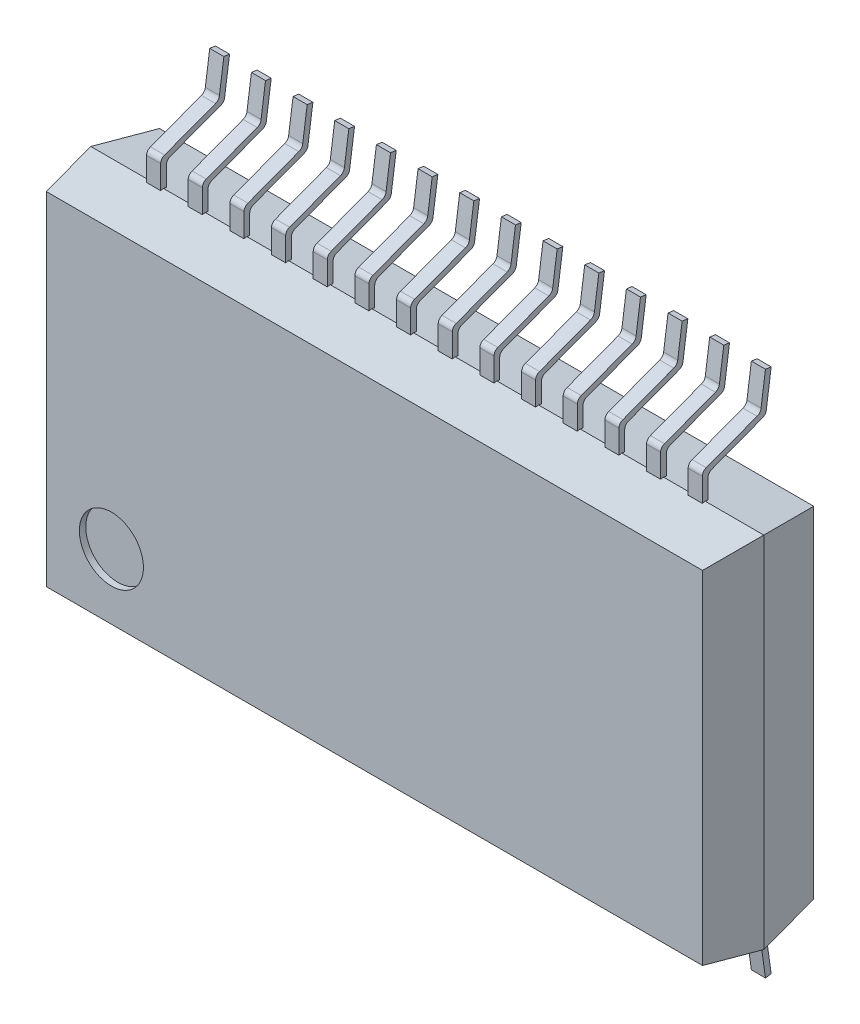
from build123d import *

# Parameters (mm, degrees)
ESBO_O1_W                  = 10.5
ESBO_O1_H                  = 5.6
EXTRUS_O1_DEPTH            = 0.925
EXTRUS_O1_TAPER            = 9
ESBO_O2_W                  = 10.5
ESBO_O2_H                  = 5.6
EXTRUS_O2_DEPTH            = 0.925
EXTRUS_O2_DRAFT            = -9
EXTRUS_O3_DEPTH            = 0.22
EXTRUS_O3_2_DEPTH          = 0.22
PADR_O_LINEAR2_COUNT       = 14
PADR_O_LINEAR2_PITCH       = 0.65
CORTE_EXTRUS_O1_DEPTH      = 0.2
CORTE_EXTRUS_O1_DEPTH_BACK = 0.2
CORTE_EXTRUS_O1_START      = 0.925
ESBO_O7_R                  = 0.5
SKETCH2_W                  = 11.354221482
SKETCH2_H                  = 6.392794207
CUT_EXTRUDE1_DEPTH         = 0.1


with BuildPart() as part:
    # Esbo_o1 → Extrus_o1 (new body)
    with BuildSketch(Plane.XY):
        with Locations((4.335, 2.8)):
            Rectangle(ESBO_O1_W, ESBO_O1_H)
    extrude(amount=EXTRUS_O1_DEPTH, taper=EXTRUS_O1_TAPER)

    # Esbo_o7 → Corte-extrus_o1 (cut, two sides: drawn at the far end of the back side and taken through both)
    with BuildSketch(Plane.XY.offset(CORTE_EXTRUS_O1_START - CORTE_EXTRUS_O1_DEPTH_BACK)):
        with Locations((0.231505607, 1.146505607)):
            Circle(ESBO_O7_R)
    extrude(amount=CORTE_EXTRUS_O1_DEPTH + CORTE_EXTRUS_O1_DEPTH_BACK, mode=Mode.SUBTRACT)

    # Sketch2 → Cut-Extrude1 (cut)
    with BuildSketch(Plane.XY.offset(0.925)):
        with Locations((4.194764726, 2.887042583)):
            Rectangle(SKETCH2_W, SKETCH2_H)
    extrude(amount=-CUT_EXTRUDE1_DEPTH, mode=Mode.SUBTRACT)


with BuildPart() as body_2:
    # Esbo_o2 → Extrus_o2 (with draft: the straight prism first)
    with BuildSketch(Plane.XY):
        with Locations((4.335, 2.8)):
            Rectangle(ESBO_O2_W, ESBO_O2_H)
    extrude(amount=-EXTRUS_O2_DEPTH)
    # Extrus_o2: the draft: its side faces are tilted about the plane it starts from
    extrus_o2_sides = [body_2.faces().sort_by_distance(p)[0] for p in [
        (-0.915, 2.8, -0.4625),
        (4.335, 0, -0.4625),
        (9.585, 2.8, -0.4625),
        (4.335, 5.6, -0.4625),
    ]]
    draft(extrus_o2_sides, Plane.XY, EXTRUS_O2_DRAFT)


with BuildPart() as body_3:
    # Esbo_o3 → Extrus_o3 (new body)
    with BuildSketch(Plane(origin=(0, 0, 0), x_dir=(0, 0, -1), z_dir=(1, 0, 0))):
        with BuildLine():
            Line((1.03, 6.9), (0.940875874, 6.912525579))
            Line((0.940875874, 6.912525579), (0.871853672, 6.421407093))
            ThreePointArc((0.871853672, 6.421407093), (0.85269388, 6.372952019), (0.810404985, 6.342511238))
            Line((0.810404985, 6.342511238), (0.016401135, 6.04365025))
            ThreePointArc((0.016401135, 6.04365025), (-0.028486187, 6.011150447), (-0.045, 5.958250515))
            Line((-0.045, 5.958250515), (-0.045, 5.5928727))
            Line((-0.045, 5.5928727), (0, 5.6))
            Line((0, 5.6), (0.045, 5.5928727))
            Line((0.045, 5.5928727), (0.045, 5.895962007))
            ThreePointArc((0.045, 5.895962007), (0.061513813, 5.94886194), (0.106401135, 5.981361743))
            Line((0.106401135, 5.981361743), (0.895282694, 6.278294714))
            ThreePointArc((0.895282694, 6.278294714), (0.933531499, 6.306508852), (0.952702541, 6.35))
            Line((0.952702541, 6.35), (1.03, 6.9))
        make_face()
    extrude(amount=EXTRUS_O3_DEPTH)


with BuildPart() as body_4:
    # Esbo_o3 → Extrus_o3 2 (new body)
    with BuildSketch(Plane(origin=(0, 0, 0), x_dir=(0, 0, -1), z_dir=(1, 0, 0))):
        with BuildLine():
            Line((0, 0), (0.045, 0.0071273))
            Line((0.045, 0.0071273), (0.045, -0.295962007))
            ThreePointArc((0.045, -0.295962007), (0.061513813, -0.34886194), (0.106401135, -0.381361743))
            Line((0.106401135, -0.381361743), (0.895282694, -0.678294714))
            ThreePointArc((0.895282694, -0.678294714), (0.933531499, -0.706508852), (0.952702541, -0.75))
            Line((0.952702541, -0.75), (1.03, -1.3))
            Line((1.03, -1.3), (0.940875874, -1.312525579))
            Line((0.940875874, -1.312525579), (0.871853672, -0.821407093))
            ThreePointArc((0.871853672, -0.821407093), (0.85269388, -0.772952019), (0.810404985, -0.742511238))
            Line((0.810404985, -0.742511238), (0.016401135, -0.44365025))
            ThreePointArc((0.016401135, -0.44365025), (-0.028486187, -0.411150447), (-0.045, -0.358250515))
            Line((-0.045, -0.358250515), (-0.045, 0.0071273))
            Line((-0.045, 0.0071273), (0, 0))
        make_face()
    extrude(amount=EXTRUS_O3_2_DEPTH)


with BuildPart() as padr_o_linear2_1:
    # Padr_o linear2: pattern copy
    add(body_4.part.moved(Location(Vector(1, 0, 0) * (1 * PADR_O_LINEAR2_PITCH))))


with BuildPart() as padr_o_linear2_2:
    # Padr_o linear2: pattern copy
    add(body_4.part.moved(Location(Vector(1, 0, 0) * (2 * PADR_O_LINEAR2_PITCH))))


with BuildPart() as padr_o_linear2_3:
    # Padr_o linear2: pattern copy
    add(body_4.part.moved(Location(Vector(1, 0, 0) * (3 * PADR_O_LINEAR2_PITCH))))


with BuildPart() as padr_o_linear2_4:
    # Padr_o linear2: pattern copy
    add(body_4.part.moved(Location(Vector(1, 0, 0) * (4 * PADR_O_LINEAR2_PITCH))))


with BuildPart() as padr_o_linear2_5:
    # Padr_o linear2: pattern copy
    add(body_4.part.moved(Location(Vector(1, 0, 0) * (5 * PADR_O_LINEAR2_PITCH))))


with BuildPart() as padr_o_linear2_6:
    # Padr_o linear2: pattern copy
    add(body_4.part.moved(Location(Vector(1, 0, 0) * (6 * PADR_O_LINEAR2_PITCH))))


with BuildPart() as padr_o_linear2_7:
    # Padr_o linear2: pattern copy
    add(body_4.part.moved(Location(Vector(1, 0, 0) * (7 * PADR_O_LINEAR2_PITCH))))


with BuildPart() as padr_o_linear2_8:
    # Padr_o linear2: pattern copy
    add(body_4.part.moved(Location(Vector(1, 0, 0) * (8 * PADR_O_LINEAR2_PITCH))))


with BuildPart() as padr_o_linear2_9:
    # Padr_o linear2: pattern copy
    add(body_4.part.moved(Location(Vector(1, 0, 0) * (9 * PADR_O_LINEAR2_PITCH))))


with BuildPart() as padr_o_linear2_10:
    # Padr_o linear2: pattern copy
    add(body_4.part.moved(Location(Vector(1, 0, 0) * (10 * PADR_O_LINEAR2_PITCH))))


with BuildPart() as padr_o_linear2_11:
    # Padr_o linear2: pattern copy
    add(body_4.part.moved(Location(Vector(1, 0, 0) * (11 * PADR_O_LINEAR2_PITCH))))


with BuildPart() as padr_o_linear2_12:
    # Padr_o linear2: pattern copy
    add(body_4.part.moved(Location(Vector(1, 0, 0) * (12 * PADR_O_LINEAR2_PITCH))))


with BuildPart() as padr_o_linear2_13:
    # Padr_o linear2: pattern copy
    add(body_4.part.moved(Location(Vector(1, 0, 0) * (13 * PADR_O_LINEAR2_PITCH))))


with BuildPart() as padr_o_linear2_14:
    # Padr_o linear2: pattern copy
    add(body_3.part.moved(Location(Vector(1, 0, 0) * (1 * PADR_O_LINEAR2_PITCH))))


with BuildPart() as padr_o_linear2_15:
    # Padr_o linear2: pattern copy
    add(body_3.part.moved(Location(Vector(1, 0, 0) * (2 * PADR_O_LINEAR2_PITCH))))


with BuildPart() as padr_o_linear2_16:
    # Padr_o linear2: pattern copy
    add(body_3.part.moved(Location(Vector(1, 0, 0) * (3 * PADR_O_LINEAR2_PITCH))))


with BuildPart() as padr_o_linear2_17:
    # Padr_o linear2: pattern copy
    add(body_3.part.moved(Location(Vector(1, 0, 0) * (4 * PADR_O_LINEAR2_PITCH))))


with BuildPart() as padr_o_linear2_18:
    # Padr_o linear2: pattern copy
    add(body_3.part.moved(Location(Vector(1, 0, 0) * (5 * PADR_O_LINEAR2_PITCH))))


with BuildPart() as padr_o_linear2_19:
    # Padr_o linear2: pattern copy
    add(body_3.part.moved(Location(Vector(1, 0, 0) * (6 * PADR_O_LINEAR2_PITCH))))


with BuildPart() as padr_o_linear2_20:
    # Padr_o linear2: pattern copy
    add(body_3.part.moved(Location(Vector(1, 0, 0) * (7 * PADR_O_LINEAR2_PITCH))))


with BuildPart() as padr_o_linear2_21:
    # Padr_o linear2: pattern copy
    add(body_3.part.moved(Location(Vector(1, 0, 0) * (8 * PADR_O_LINEAR2_PITCH))))


with BuildPart() as padr_o_linear2_22:
    # Padr_o linear2: pattern copy
    add(body_3.part.moved(Location(Vector(1, 0, 0) * (9 * PADR_O_LINEAR2_PITCH))))


with BuildPart() as padr_o_linear2_23:
    # Padr_o linear2: pattern copy
    add(body_3.part.moved(Location(Vector(1, 0, 0) * (10 * PADR_O_LINEAR2_PITCH))))


with BuildPart() as padr_o_linear2_24:
    # Padr_o linear2: pattern copy
    add(body_3.part.moved(Location(Vector(1, 0, 0) * (11 * PADR_O_LINEAR2_PITCH))))


with BuildPart() as padr_o_linear2_25:
    # Padr_o linear2: pattern copy
    add(body_3.part.moved(Location(Vector(1, 0, 0) * (12 * PADR_O_LINEAR2_PITCH))))


with BuildPart() as padr_o_linear2_26:
    # Padr_o linear2: pattern copy
    add(body_3.part.moved(Location(Vector(1, 0, 0) * (13 * PADR_O_LINEAR2_PITCH))))


solid = Compound([part.part, body_2.part, body_3.part, body_4.part, padr_o_linear2_1.part, padr_o_linear2_2.part, padr_o_linear2_3.part, padr_o_linear2_4.part, padr_o_linear2_5.part, padr_o_linear2_6.part, padr_o_linear2_7.part, padr_o_linear2_8.part, padr_o_linear2_9.part, padr_o_linear2_10.part, padr_o_linear2_11.part, padr_o_linear2_12.part, padr_o_linear2_13.part, padr_o_linear2_14.part, padr_o_linear2_15.part, padr_o_linear2_16.part, padr_o_linear2_17.part, padr_o_linear2_18.part, padr_o_linear2_19.part, padr_o_linear2_20.part, padr_o_linear2_21.part, padr_o_linear2_22.part, padr_o_linear2_23.part, padr_o_linear2_24.part, padr_o_linear2_25.part, padr_o_linear2_26.part])
